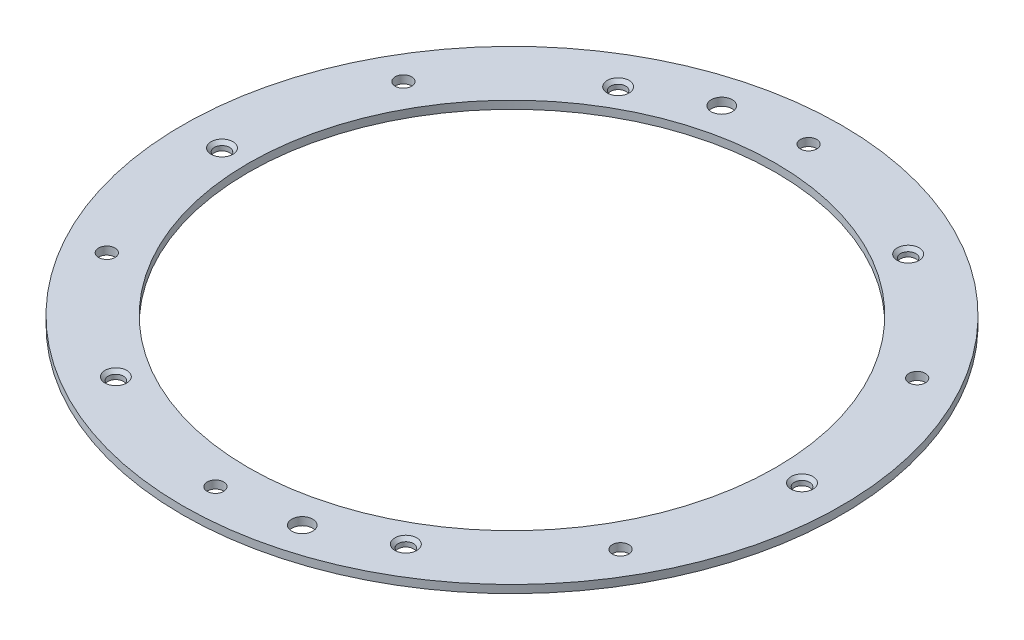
from build123d import *

# Parameters (mm, degrees)
SKETCH1_R                      = 63.5
SKETCH1_R_2                    = 50.8
BOSS_EXTRUDE1_DEPTH            = 1.524
SKETCH2_R                      = 1.5875
CUT_EXTRUDE1_DEPTH             = 90.815491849
F_4_CLEARANCE_HOLE1_AT_2_COUNT = 2
F_4_CLEARANCE_HOLE1_AT_2_PITCH = 55.88
F_4_CLEARANCE_HOLE1_AT_3_COUNT = 2
F_4_CLEARANCE_HOLE1_AT_3_PITCH = 96.786999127
F_4_CLEARANCE_HOLE1_AT_4_COUNT = 2
F_4_CLEARANCE_HOLE1_AT_4_PITCH = 111.76
F_4_CLEARANCE_HOLE1_AT_5_COUNT = 2
F_4_CLEARANCE_HOLE1_AT_5_PITCH = 96.786999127
F_4_CLEARANCE_HOLE1_AT_6_COUNT = 2
F_4_CLEARANCE_HOLE1_AT_6_PITCH = 55.88
F_10_32_TAPPED_HOLE1_D         = 4.0386


with BuildPart() as part:
    # Sketch1 → Boss-Extrude1 (new body)
    with BuildSketch(Plane(origin=(0, 0, 0), x_dir=(1, 0, 0), z_dir=(0, 1, 0))):
        with Locations(Location((0, 0, 0), (0, 0, 90))):
            Circle(SKETCH1_R)
        with Locations(Location((0, 0, 0), (0, 0, 90))):
            Circle(SKETCH1_R_2, mode=Mode.SUBTRACT)
    extrude(amount=BOSS_EXTRUDE1_DEPTH)

    # Sketch2 → Cut-Extrude1 (cut, through all)
    with BuildSketch(Plane(origin=(0, 1.524, 0), x_dir=(1, 0, 0), z_dir=(0, 1, 0))):
        with Locations(Location((0, 57.15, 0), (0, 0, 270))):
            Circle(SKETCH2_R)
        with Locations(Location((49.493351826, 28.575, 0), (0, 0, 270))):
            Circle(SKETCH2_R)
        with Locations(Location((49.493351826, -28.575, 0), (0, 0, 270))):
            Circle(SKETCH2_R)
        with Locations(Location((0, -57.15, 0), (0, 0, 270))):
            Circle(SKETCH2_R)
        with Locations(Location((-49.493351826, -28.575, 0), (0, 0, 270))):
            Circle(SKETCH2_R)
        with Locations(Location((-49.493351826, 28.575, 0), (0, 0, 270))):
            Circle(SKETCH2_R)
    extrude(amount=-CUT_EXTRUDE1_DEPTH, mode=Mode.SUBTRACT)

    # Sketch5 → 4 Clearance Hole1 (revolve, cut)
    with BuildSketch(Plane(origin=(-27.94, 1.524, -48.393499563), x_dir=(0, 0, 1), z_dir=(1, 0, 0))):
        Polygon((0, 0), (0, 1.524), (1.4732, 1.524), (1.4732, 0.635), (2.1082, 0), align=None)
    f_4_clearance_hole1 = revolve(axis=Axis((-27.94, 7.874, -48.393499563), (0, -1, 0)), mode=Mode.SUBTRACT)

    # 4 Clearance Hole1 at 2: 4 Clearance Hole1 ×2
    with Locations(*[(i * F_4_CLEARANCE_HOLE1_AT_2_PITCH, 0, 0) for i in range(1, F_4_CLEARANCE_HOLE1_AT_2_COUNT)]):
        add(f_4_clearance_hole1, mode=Mode.SUBTRACT)

    # 4 Clearance Hole1 at 3: 4 Clearance Hole1 ×2
    with Locations(*[Vector(0.8660254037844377, 0, 0.5000000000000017) * (i * F_4_CLEARANCE_HOLE1_AT_3_PITCH) for i in range(1, F_4_CLEARANCE_HOLE1_AT_3_COUNT)]):
        add(f_4_clearance_hole1, mode=Mode.SUBTRACT)

    # 4 Clearance Hole1 at 4: 4 Clearance Hole1 ×2
    with Locations(*[Vector(0.4999999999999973, 0, 0.8660254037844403) * (i * F_4_CLEARANCE_HOLE1_AT_4_PITCH) for i in range(1, F_4_CLEARANCE_HOLE1_AT_4_COUNT)]):
        add(f_4_clearance_hole1, mode=Mode.SUBTRACT)

    # 4 Clearance Hole1 at 5: 4 Clearance Hole1 ×2
    with Locations(*[(0, 0, i * F_4_CLEARANCE_HOLE1_AT_5_PITCH) for i in range(1, F_4_CLEARANCE_HOLE1_AT_5_COUNT)]):
        add(f_4_clearance_hole1, mode=Mode.SUBTRACT)

    # 4 Clearance Hole1 at 6: 4 Clearance Hole1 ×2
    with Locations(*[Vector(-0.5000000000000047, 0, 0.866025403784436) * (i * F_4_CLEARANCE_HOLE1_AT_6_PITCH) for i in range(1, F_4_CLEARANCE_HOLE1_AT_6_COUNT)]):
        add(f_4_clearance_hole1, mode=Mode.SUBTRACT)

    # 10-32 Tapped Hole1 (through all)
    with Locations(Plane(origin=(0, 1.524, 0), x_dir=(1, 0, 0), z_dir=(0, 1, 0))):
        with Locations((-14.791508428, 55.202660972), (14.791508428, -55.202660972)):
            Hole(F_10_32_TAPPED_HOLE1_D / 2)


solid = part.part
